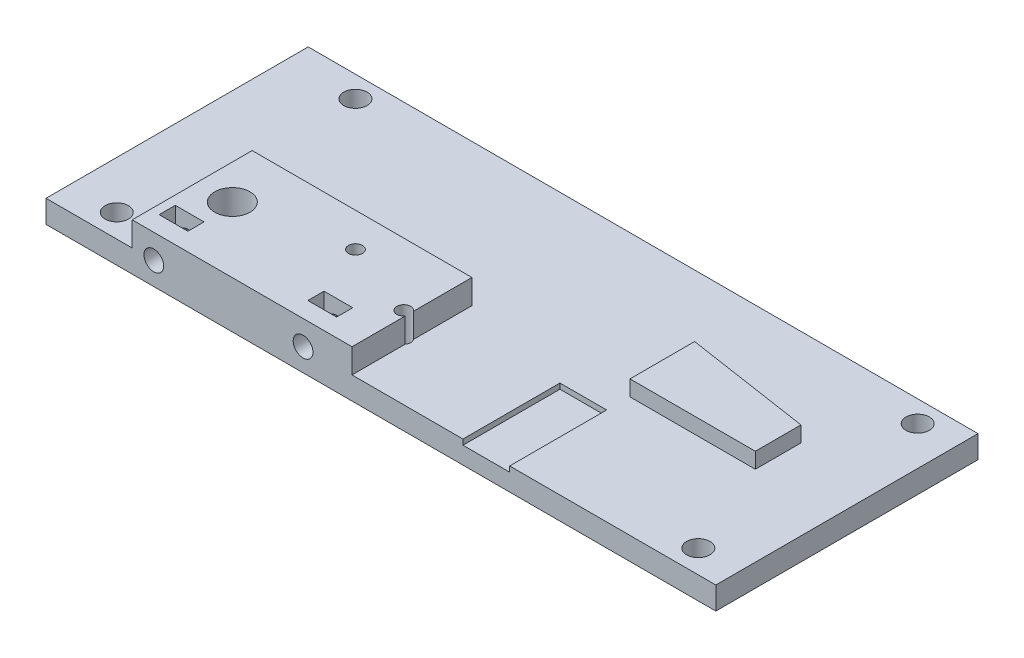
from build123d import *

# Parameters (mm, degrees)
SKETCH1_W           = 186.5
SKETCH1_H           = 73
BOSS_EXTRUDE1_DEPTH = 6.3
SKETCH2_W           = 61.2
SKETCH2_H           = 33.4
BOSS_EXTRUDE2_DEPTH = 6.8
BOSS_EXTRUDE3_DEPTH = 4.35
SKETCH4_R           = 3.25
SKETCH4_R_2         = 4.925
SKETCH4_R_3         = 1.95
CUT_EXTRUDE1_DEPTH  = 101.992190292
SKETCH5_R           = 2.75
CUT_EXTRUDE2_DEPTH  = 12
SKETCH7_W           = 8
SKETCH7_H           = 4.5
CUT_EXTRUDE3_DEPTH  = 101.992190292
SKETCH8_W           = 34.9
SKETCH8_H           = 20
CUT_EXTRUDE4_DEPTH  = 4.35
SKETCH9_W           = 13
SKETCH9_H           = 27
CUT_EXTRUDE5_DEPTH  = 1.5


with BuildPart() as part:
    # Sketch1 → Boss-Extrude1 (new body)
    with BuildSketch(Plane(origin=(0, 0, 0), x_dir=(1, 0, 0), z_dir=(0, 1, 0))):
        Rectangle(SKETCH1_W, SKETCH1_H)
    extrude(amount=BOSS_EXTRUDE1_DEPTH)

    # Sketch2 → Boss-Extrude2 (add)
    with BuildSketch(Plane(origin=(0, 6.3, 0), x_dir=(1, 0, 0), z_dir=(0, 1, 0))):
        with Locations((-38.65, -19.8)):
            Rectangle(SKETCH2_W, SKETCH2_H)
    extrude(amount=BOSS_EXTRUDE2_DEPTH)

    # Sketch3 → Boss-Extrude3 (add)
    with BuildSketch(Plane(origin=(0, 6.3, 0), x_dir=(1, 0, 0), z_dir=(0, 1, 0))):
        Polygon((35.95, -23.1), (70.85, -23.1), (70.85, 9.6), (35.95, 14.9), align=None)
    extrude(amount=BOSS_EXTRUDE3_DEPTH)

    # Sketch4 → Cut-Extrude1 (cut, through all)
    with BuildSketch(Plane.XZ):
        with Locations(Location((-80, 30.05, 0), (0, 0, 270))):
            Circle(SKETCH4_R)
        with Locations(Location((-74.15, -30.55, 0), (0, 0, 270))):
            Circle(SKETCH4_R)
        with Locations(Location((82.45, -30.5, 0), (0, 0, 270))):
            Circle(SKETCH4_R)
        with Locations(Location((81.925, 30.05, 0), (0, 0, 270))):
            Circle(SKETCH4_R)
        with Locations(Location((-59.6038, 18.2644, 0), (0, 0, 270))):
            Circle(SKETCH4_R_2)
        with Locations(Location((-31.0288, 12.5494, 0), (0, 0, 270))):
            Circle(SKETCH4_R_3)
        with Locations(Location((-9.6166, 20.525, 0), (0, 0, 270))):
            Circle(SKETCH4_R_3)
    extrude(amount=-CUT_EXTRUDE1_DEPTH, mode=Mode.SUBTRACT)

    # Sketch5 → Cut-Extrude2 (cut)
    with BuildSketch(Plane.XY.offset(36.5)):
        with Locations((-63.225, 6.325)):
            Circle(SKETCH5_R)
        with Locations((-21.675, 6.325)):
            Circle(SKETCH5_R)
    extrude(amount=-CUT_EXTRUDE2_DEPTH, mode=Mode.SUBTRACT)

    # Sketch7 → Cut-Extrude3 (cut, through all)
    with BuildSketch(Plane.XZ):
        with Locations((-62.75, 29.25)):
            Rectangle(SKETCH7_W, SKETCH7_H)
        with Locations((-21.35, 29.25)):
            Rectangle(SKETCH7_W, SKETCH7_H)
    extrude(amount=-CUT_EXTRUDE3_DEPTH, mode=Mode.SUBTRACT)

    # Sketch8 → Cut-Extrude4 (cut)
    with BuildSketch(Plane(origin=(0, 10.65, 0), x_dir=(1, 0, 0), z_dir=(0, 1, 0))):
        with Locations((53.4, -13.1)):
            Rectangle(SKETCH8_W, SKETCH8_H)
    extrude(amount=-CUT_EXTRUDE4_DEPTH, mode=Mode.SUBTRACT)

    # Sketch9 → Cut-Extrude5 (cut)
    with BuildSketch(Plane(origin=(0, 6.3, 0), x_dir=(1, 0, 0), z_dir=(0, 1, 0))):
        with Locations((29.35, -23)):
            Rectangle(SKETCH9_W, SKETCH9_H)
    extrude(amount=-CUT_EXTRUDE5_DEPTH, mode=Mode.SUBTRACT)


solid = part.part
